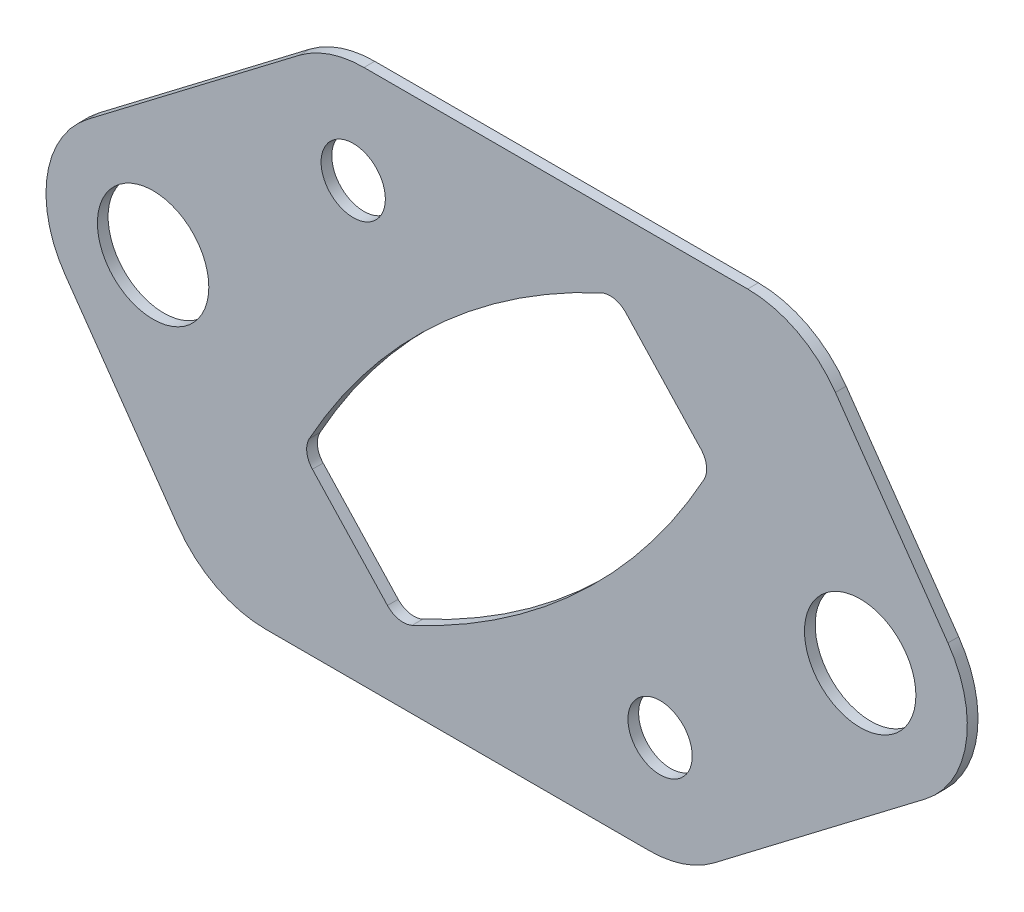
ISO-10303-21;
HEADER;
FILE_DESCRIPTION(('STEP AP214'),'2;1');
FILE_NAME('part.step','',(''),(''),'','','');
FILE_SCHEMA(('AUTOMOTIVE_DESIGN { 1 0 10303 214 1 1 1 1 }'));
ENDSEC;
DATA;
#1=APPLICATION_CONTEXT('core data for automotive mechanical design processes');
#2=APPLICATION_PROTOCOL_DEFINITION('international standard','automotive_design',2000,#1);
#3=PRODUCT_CONTEXT('',#1,'mechanical');
#4=PRODUCT('Part','Part','',(#3));
#5=PRODUCT_RELATED_PRODUCT_CATEGORY('part','',(#4));
#6=PRODUCT_DEFINITION_FORMATION('','',#4);
#7=PRODUCT_DEFINITION_CONTEXT('part definition',#1,'design');
#8=PRODUCT_DEFINITION('design','',#6,#7);
#9=PRODUCT_DEFINITION_SHAPE('','',#8);
#10=(LENGTH_UNIT() NAMED_UNIT(*) SI_UNIT(.MILLI.,.METRE.));
#11=(NAMED_UNIT(*) PLANE_ANGLE_UNIT() SI_UNIT($,.RADIAN.));
#12=(NAMED_UNIT(*) SI_UNIT($,.STERADIAN.) SOLID_ANGLE_UNIT());
#13=UNCERTAINTY_MEASURE_WITH_UNIT(LENGTH_MEASURE(1.E-05),#10,'distance_accuracy_value','');
#14=(GEOMETRIC_REPRESENTATION_CONTEXT(3) GLOBAL_UNCERTAINTY_ASSIGNED_CONTEXT((#13)) GLOBAL_UNIT_ASSIGNED_CONTEXT((#10,
#11,#12)) REPRESENTATION_CONTEXT('',''));
#15=CARTESIAN_POINT('',(0.,0.,0.));
#16=DIRECTION('',(0.,0.,1.));
#17=DIRECTION('',(1.,0.,0.));
#18=AXIS2_PLACEMENT_3D('',#15,#16,#17);
#19=CARTESIAN_POINT('',(0.,0.,0.));
#20=DIRECTION('',(0.,0.,1.));
#21=DIRECTION('',(1.,0.,0.));
#22=AXIS2_PLACEMENT_3D('',#19,#20,#21);
#23=PLANE('',#22);
#24=CARTESIAN_POINT('',(-17.04995900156,18.28384254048,0.));
#25=DIRECTION('',(0.,0.,1.));
#26=DIRECTION('',(1.,0.,0.));
#27=AXIS2_PLACEMENT_3D('',#24,#25,#26);
#28=CIRCLE('',#27,30.);
#29=CARTESIAN_POINT('',(-4.40939282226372,-8.92306993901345,0.));
#30=VERTEX_POINT('',#29);
#31=CARTESIAN_POINT('',(9.2089174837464,3.77620986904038,0.));
#32=VERTEX_POINT('',#31);
#33=EDGE_CURVE('E181',#30,#32,#28,.T.);
#34=ORIENTED_EDGE('',*,*,#33,.T.);
#35=CARTESIAN_POINT('',(8.333621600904,4.259797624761,0.));
#36=DIRECTION('',(0.,0.,1.));
#37=DIRECTION('',(1.,0.,0.));
#38=AXIS2_PLACEMENT_3D('',#35,#36,#37);
#39=CIRCLE('',#38,1.);
#40=CARTESIAN_POINT('',(9.06497530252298,4.94179598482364,0.));
#41=VERTEX_POINT('',#40);
#42=EDGE_CURVE('E184',#32,#41,#39,.T.);
#43=ORIENTED_EDGE('',*,*,#42,.T.);
#44=DIRECTION('',(0.681998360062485,-0.731353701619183,0.));
#45=VECTOR('',#44,1.);
#46=CARTESIAN_POINT('',(5.56209872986,8.698171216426,0.));
#47=LINE('',#46,#45);
#48=CARTESIAN_POINT('',(5.56209872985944,8.6981712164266,0.));
#49=VERTEX_POINT('',#48);
#50=EDGE_CURVE('E188',#49,#41,#47,.T.);
#51=ORIENTED_EDGE('',*,*,#50,.F.);
#52=CARTESIAN_POINT('',(4.830745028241,8.016172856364,0.));
#53=DIRECTION('',(0.,0.,1.));
#54=DIRECTION('',(1.,0.,0.));
#55=AXIS2_PLACEMENT_3D('',#52,#53,#54);
#56=CIRCLE('',#55,1.);
#57=CARTESIAN_POINT('',(4.40939282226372,8.92306993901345,0.));
#58=VERTEX_POINT('',#57);
#59=EDGE_CURVE('E191',#49,#58,#56,.T.);
#60=ORIENTED_EDGE('',*,*,#59,.T.);
#61=CARTESIAN_POINT('',(17.04995900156,-18.28384254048,0.));
#62=DIRECTION('',(0.,0.,1.));
#63=DIRECTION('',(1.,0.,0.));
#64=AXIS2_PLACEMENT_3D('',#61,#62,#63);
#65=CIRCLE('',#64,30.);
#66=CARTESIAN_POINT('',(-9.2089174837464,-3.77620986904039,0.));
#67=VERTEX_POINT('',#66);
#68=EDGE_CURVE('E195',#58,#67,#65,.T.);
#69=ORIENTED_EDGE('',*,*,#68,.T.);
#70=CARTESIAN_POINT('',(-8.333621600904,-4.259797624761,0.));
#71=DIRECTION('',(0.,0.,1.));
#72=DIRECTION('',(1.,0.,0.));
#73=AXIS2_PLACEMENT_3D('',#70,#71,#72);
#74=CIRCLE('',#73,1.);
#75=CARTESIAN_POINT('',(-9.06497530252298,-4.94179598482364,0.));
#76=VERTEX_POINT('',#75);
#77=EDGE_CURVE('E162',#67,#76,#74,.T.);
#78=ORIENTED_EDGE('',*,*,#77,.T.);
#79=DIRECTION('',(-0.681998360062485,0.731353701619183,0.));
#80=VECTOR('',#79,1.);
#81=CARTESIAN_POINT('',(-5.56209872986,-8.698171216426,0.));
#82=LINE('',#81,#80);
#83=CARTESIAN_POINT('',(-5.56209872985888,-8.69817121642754,0.));
#84=VERTEX_POINT('',#83);
#85=EDGE_CURVE('E159',#84,#76,#82,.T.);
#86=ORIENTED_EDGE('',*,*,#85,.F.);
#87=CARTESIAN_POINT('',(-4.830745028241,-8.016172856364,0.));
#88=DIRECTION('',(0.,0.,1.));
#89=DIRECTION('',(1.,0.,0.));
#90=AXIS2_PLACEMENT_3D('',#87,#88,#89);
#91=CIRCLE('',#90,1.);
#92=EDGE_CURVE('E20',#30,#84,#91,.F.);
#93=ORIENTED_EDGE('',*,*,#92,.F.);
#94=EDGE_LOOP('',(#34,#43,#51,#60,#69,#78,#86,#93));
#95=FACE_BOUND('',#94,.T.);
#96=CARTESIAN_POINT('',(-7.160982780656,7.679213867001,0.));
#97=DIRECTION('',(0.,0.,1.));
#98=DIRECTION('',(1.,0.,0.));
#99=AXIS2_PLACEMENT_3D('',#96,#97,#98);
#100=CIRCLE('',#99,1.5);
#101=CARTESIAN_POINT('',(-5.660982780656,7.679213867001,0.));
#102=VERTEX_POINT('',#101);
#103=EDGE_CURVE('E165',#102,#102,#100,.T.);
#104=ORIENTED_EDGE('',*,*,#103,.T.);
#105=EDGE_LOOP('',(#104));
#106=FACE_BOUND('',#105,.T.);
#107=CARTESIAN_POINT('',(7.160982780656,-7.679213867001,0.));
#108=DIRECTION('',(0.,0.,1.));
#109=DIRECTION('',(1.,0.,0.));
#110=AXIS2_PLACEMENT_3D('',#107,#108,#109);
#111=CIRCLE('',#110,1.5);
#112=CARTESIAN_POINT('',(8.660982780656,-7.679213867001,0.));
#113=VERTEX_POINT('',#112);
#114=EDGE_CURVE('E307',#113,#113,#111,.T.);
#115=ORIENTED_EDGE('',*,*,#114,.T.);
#116=EDGE_LOOP('',(#115));
#117=FACE_BOUND('',#116,.T.);
#118=CARTESIAN_POINT('',(-16.5,0.,0.));
#119=DIRECTION('',(0.,0.,1.));
#120=DIRECTION('',(1.,0.,0.));
#121=AXIS2_PLACEMENT_3D('',#118,#119,#120);
#122=CIRCLE('',#121,2.6);
#123=CARTESIAN_POINT('',(-13.9,0.,0.));
#124=VERTEX_POINT('',#123);
#125=EDGE_CURVE('E310',#124,#124,#122,.T.);
#126=ORIENTED_EDGE('',*,*,#125,.T.);
#127=EDGE_LOOP('',(#126));
#128=FACE_BOUND('',#127,.T.);
#129=CARTESIAN_POINT('',(16.5,0.,0.));
#130=DIRECTION('',(0.,0.,1.));
#131=DIRECTION('',(1.,0.,0.));
#132=AXIS2_PLACEMENT_3D('',#129,#130,#131);
#133=CIRCLE('',#132,2.6);
#134=CARTESIAN_POINT('',(19.1,0.,0.));
#135=VERTEX_POINT('',#134);
#136=EDGE_CURVE('E313',#135,#135,#133,.T.);
#137=ORIENTED_EDGE('',*,*,#136,.T.);
#138=EDGE_LOOP('',(#137));
#139=FACE_BOUND('',#138,.T.);
#140=CARTESIAN_POINT('',(-6.656696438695,7.5,0.));
#141=DIRECTION('',(0.,0.,1.));
#142=DIRECTION('',(1.,0.,0.));
#143=AXIS2_PLACEMENT_3D('',#140,#141,#142);
#144=CIRCLE('',#143,5.);
#145=CARTESIAN_POINT('',(-6.656696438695,12.5,0.));
#146=VERTEX_POINT('',#145);
#147=CARTESIAN_POINT('',(-9.68699946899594,11.4770923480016,0.));
#148=VERTEX_POINT('',#147);
#149=EDGE_CURVE('E209',#146,#148,#144,.T.);
#150=ORIENTED_EDGE('',*,*,#149,.F.);
#151=DIRECTION('',(1.,0.,0.));
#152=VECTOR('',#151,1.);
#153=CARTESIAN_POINT('',(11.24844346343,12.5,0.));
#154=LINE('',#153,#152);
#155=CARTESIAN_POINT('',(11.24844346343,12.5,0.));
#156=VERTEX_POINT('',#155);
#157=EDGE_CURVE('E213',#156,#146,#154,.F.);
#158=ORIENTED_EDGE('',*,*,#157,.F.);
#159=CARTESIAN_POINT('',(11.24844346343,7.5,0.));
#160=DIRECTION('',(0.,0.,1.));
#161=DIRECTION('',(1.,0.,0.));
#162=AXIS2_PLACEMENT_3D('',#159,#160,#161);
#163=CIRCLE('',#162,5.);
#164=CARTESIAN_POINT('',(15.3442036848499,10.3678821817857,0.));
#165=VERTEX_POINT('',#164);
#166=EDGE_CURVE('E217',#165,#156,#163,.T.);
#167=ORIENTED_EDGE('',*,*,#166,.F.);
#168=DIRECTION('',(-0.573576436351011,0.819152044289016,0.));
#169=VECTOR('',#168,1.);
#170=CARTESIAN_POINT('',(20.59576022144,2.867882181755,0.));
#171=LINE('',#170,#169);
#172=CARTESIAN_POINT('',(20.5957602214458,2.86788218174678,0.));
#173=VERTEX_POINT('',#172);
#174=EDGE_CURVE('E221',#173,#165,#171,.T.);
#175=ORIENTED_EDGE('',*,*,#174,.F.);
#176=CARTESIAN_POINT('',(16.5,0.,0.));
#177=DIRECTION('',(0.,0.,1.));
#178=DIRECTION('',(1.,0.,0.));
#179=AXIS2_PLACEMENT_3D('',#176,#177,#178);
#180=CIRCLE('',#179,5.);
#181=CARTESIAN_POINT('',(19.5303030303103,-3.97709234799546,0.));
#182=VERTEX_POINT('',#181);
#183=EDGE_CURVE('E225',#182,#173,#180,.T.);
#184=ORIENTED_EDGE('',*,*,#183,.F.);
#185=DIRECTION('',(0.795418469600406,0.606060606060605,0.));
#186=VECTOR('',#185,1.);
#187=CARTESIAN_POINT('',(9.686999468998,-11.477092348,0.));
#188=LINE('',#187,#186);
#189=CARTESIAN_POINT('',(9.68699946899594,-11.4770923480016,0.));
#190=VERTEX_POINT('',#189);
#191=EDGE_CURVE('E229',#190,#182,#188,.T.);
#192=ORIENTED_EDGE('',*,*,#191,.F.);
#193=CARTESIAN_POINT('',(6.656696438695,-7.5,0.));
#194=DIRECTION('',(0.,0.,1.));
#195=DIRECTION('',(1.,0.,0.));
#196=AXIS2_PLACEMENT_3D('',#193,#194,#195);
#197=CIRCLE('',#196,5.);
#198=CARTESIAN_POINT('',(6.656696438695,-12.5,0.));
#199=VERTEX_POINT('',#198);
#200=EDGE_CURVE('E233',#199,#190,#197,.T.);
#201=ORIENTED_EDGE('',*,*,#200,.F.);
#202=DIRECTION('',(1.,0.,0.));
#203=VECTOR('',#202,1.);
#204=CARTESIAN_POINT('',(-11.24844346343,-12.5,0.));
#205=LINE('',#204,#203);
#206=CARTESIAN_POINT('',(-11.24844346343,-12.5,0.));
#207=VERTEX_POINT('',#206);
#208=EDGE_CURVE('E237',#207,#199,#205,.T.);
#209=ORIENTED_EDGE('',*,*,#208,.F.);
#210=CARTESIAN_POINT('',(-11.24844346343,-7.5,0.));
#211=DIRECTION('',(0.,0.,1.));
#212=DIRECTION('',(1.,0.,0.));
#213=AXIS2_PLACEMENT_3D('',#210,#211,#212);
#214=CIRCLE('',#213,5.);
#215=CARTESIAN_POINT('',(-15.3442036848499,-10.3678821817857,0.));
#216=VERTEX_POINT('',#215);
#217=EDGE_CURVE('E241',#216,#207,#214,.T.);
#218=ORIENTED_EDGE('',*,*,#217,.F.);
#219=DIRECTION('',(0.573576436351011,-0.819152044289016,0.));
#220=VECTOR('',#219,1.);
#221=CARTESIAN_POINT('',(-20.59576022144,-2.867882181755,0.));
#222=LINE('',#221,#220);
#223=CARTESIAN_POINT('',(-20.5957602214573,-2.86788218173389,0.));
#224=VERTEX_POINT('',#223);
#225=EDGE_CURVE('E157',#224,#216,#222,.T.);
#226=ORIENTED_EDGE('',*,*,#225,.F.);
#227=CARTESIAN_POINT('',(-16.5,0.,0.));
#228=DIRECTION('',(0.,0.,1.));
#229=DIRECTION('',(1.,0.,0.));
#230=AXIS2_PLACEMENT_3D('',#227,#228,#229);
#231=CIRCLE('',#230,5.);
#232=CARTESIAN_POINT('',(-19.5303030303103,3.97709234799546,0.));
#233=VERTEX_POINT('',#232);
#234=EDGE_CURVE('E205',#233,#224,#231,.T.);
#235=ORIENTED_EDGE('',*,*,#234,.F.);
#236=DIRECTION('',(-0.795418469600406,-0.606060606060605,0.));
#237=VECTOR('',#236,1.);
#238=CARTESIAN_POINT('',(-9.686999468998,11.477092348,0.));
#239=LINE('',#238,#237);
#240=EDGE_CURVE('E202',#148,#233,#239,.T.);
#241=ORIENTED_EDGE('',*,*,#240,.F.);
#242=EDGE_LOOP('',(#150,#158,#167,#175,#184,#192,#201,#209,#218,#226,#235,#241));
#243=FACE_BOUND('',#242,.T.);
#244=ADVANCED_FACE('F16',(#95,#106,#117,#128,#139,#243),#23,.F.);
#245=CARTESIAN_POINT('',(-20.59576022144,-2.867882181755,0.));
#246=DIRECTION('',(-0.819152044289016,-0.573576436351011,0.));
#247=DIRECTION('',(0.573576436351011,-0.819152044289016,0.));
#248=AXIS2_PLACEMENT_3D('',#245,#246,#247);
#249=PLANE('',#248);
#250=DIRECTION('',(0.,0.,1.));
#251=VECTOR('',#250,1.);
#252=CARTESIAN_POINT('',(-20.595760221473,-2.86788218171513,0.));
#253=LINE('',#252,#251);
#254=CARTESIAN_POINT('',(-20.5957602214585,-2.8678821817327,0.5));
#255=VERTEX_POINT('',#254);
#256=EDGE_CURVE('E198',#224,#255,#253,.T.);
#257=ORIENTED_EDGE('',*,*,#256,.F.);
#258=ORIENTED_EDGE('',*,*,#225,.T.);
#259=DIRECTION('',(0.,0.,1.));
#260=VECTOR('',#259,1.);
#261=CARTESIAN_POINT('',(-15.3442036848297,-10.3678821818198,0.));
#262=LINE('',#261,#260);
#263=CARTESIAN_POINT('',(-15.3442036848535,-10.3678821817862,0.5));
#264=VERTEX_POINT('',#263);
#265=EDGE_CURVE('E242',#264,#216,#262,.F.);
#266=ORIENTED_EDGE('',*,*,#265,.F.);
#267=DIRECTION('',(0.573576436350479,-0.819152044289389,0.));
#268=VECTOR('',#267,1.);
#269=CARTESIAN_POINT('',(-20.59576022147,-2.867882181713,0.5));
#270=LINE('',#269,#268);
#271=EDGE_CURVE('E171',#255,#264,#270,.T.);
#272=ORIENTED_EDGE('',*,*,#271,.F.);
#273=EDGE_LOOP('',(#257,#258,#266,#272));
#274=FACE_BOUND('',#273,.T.);
#275=ADVANCED_FACE('F342',(#274),#249,.T.);
#276=CARTESIAN_POINT('',(-11.24844346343,-7.5,0.));
#277=DIRECTION('',(0.,0.,1.));
#278=DIRECTION('',(1.,0.,0.));
#279=AXIS2_PLACEMENT_3D('',#276,#277,#278);
#280=CYLINDRICAL_SURFACE('',#279,5.);
#281=ORIENTED_EDGE('',*,*,#265,.T.);
#282=ORIENTED_EDGE('',*,*,#217,.T.);
#283=DIRECTION('',(0.,0.,-1.));
#284=VECTOR('',#283,1.);
#285=CARTESIAN_POINT('',(-11.24844346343,-12.5,0.));
#286=LINE('',#285,#284);
#287=CARTESIAN_POINT('',(-11.24844346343,-12.5,0.5));
#288=VERTEX_POINT('',#287);
#289=EDGE_CURVE('E238',#288,#207,#286,.T.);
#290=ORIENTED_EDGE('',*,*,#289,.F.);
#291=CARTESIAN_POINT('',(-11.24844346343,-7.5,0.5));
#292=DIRECTION('',(0.,0.,1.));
#293=DIRECTION('',(1.,0.,0.));
#294=AXIS2_PLACEMENT_3D('',#291,#292,#293);
#295=CIRCLE('',#294,5.);
#296=EDGE_CURVE('E174',#264,#288,#295,.T.);
#297=ORIENTED_EDGE('',*,*,#296,.F.);
#298=EDGE_LOOP('',(#281,#282,#290,#297));
#299=FACE_BOUND('',#298,.T.);
#300=ADVANCED_FACE('F324',(#299),#280,.T.);
#301=CARTESIAN_POINT('',(-11.24844346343,-12.5,0.));
#302=DIRECTION('',(0.,-1.,0.));
#303=DIRECTION('',(0.,0.,-1.));
#304=AXIS2_PLACEMENT_3D('',#301,#302,#303);
#305=PLANE('',#304);
#306=ORIENTED_EDGE('',*,*,#289,.T.);
#307=ORIENTED_EDGE('',*,*,#208,.T.);
#308=DIRECTION('',(0.,0.,1.));
#309=VECTOR('',#308,1.);
#310=CARTESIAN_POINT('',(6.656696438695,-12.5,0.));
#311=LINE('',#310,#309);
#312=CARTESIAN_POINT('',(6.656696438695,-12.5,0.5));
#313=VERTEX_POINT('',#312);
#314=EDGE_CURVE('E234',#313,#199,#311,.F.);
#315=ORIENTED_EDGE('',*,*,#314,.F.);
#316=DIRECTION('',(1.,0.,0.));
#317=VECTOR('',#316,1.);
#318=CARTESIAN_POINT('',(0.,-12.5,0.5));
#319=LINE('',#318,#317);
#320=EDGE_CURVE('E297',#288,#313,#319,.T.);
#321=ORIENTED_EDGE('',*,*,#320,.F.);
#322=EDGE_LOOP('',(#306,#307,#315,#321));
#323=FACE_BOUND('',#322,.T.);
#324=ADVANCED_FACE('F332',(#323),#305,.T.);
#325=CARTESIAN_POINT('',(6.656696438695,-7.5,0.));
#326=DIRECTION('',(0.,0.,1.));
#327=DIRECTION('',(1.,0.,0.));
#328=AXIS2_PLACEMENT_3D('',#325,#326,#327);
#329=CYLINDRICAL_SURFACE('',#328,5.);
#330=ORIENTED_EDGE('',*,*,#314,.T.);
#331=ORIENTED_EDGE('',*,*,#200,.T.);
#332=DIRECTION('',(0.,0.,1.));
#333=VECTOR('',#332,1.);
#334=CARTESIAN_POINT('',(9.68699946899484,-11.4770923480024,0.));
#335=LINE('',#334,#333);
#336=CARTESIAN_POINT('',(9.6869994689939,-11.4770923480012,0.5));
#337=VERTEX_POINT('',#336);
#338=EDGE_CURVE('E230',#337,#190,#335,.F.);
#339=ORIENTED_EDGE('',*,*,#338,.F.);
#340=CARTESIAN_POINT('',(6.656696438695,-7.5,0.5));
#341=DIRECTION('',(0.,0.,1.));
#342=DIRECTION('',(1.,0.,0.));
#343=AXIS2_PLACEMENT_3D('',#340,#341,#342);
#344=CIRCLE('',#343,5.);
#345=EDGE_CURVE('E294',#313,#337,#344,.T.);
#346=ORIENTED_EDGE('',*,*,#345,.F.);
#347=EDGE_LOOP('',(#330,#331,#339,#346));
#348=FACE_BOUND('',#347,.T.);
#349=ADVANCED_FACE('F542',(#348),#329,.T.);
#350=CARTESIAN_POINT('',(9.686999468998,-11.477092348,0.));
#351=DIRECTION('',(0.606060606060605,-0.795418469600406,0.));
#352=DIRECTION('',(0.795418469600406,0.606060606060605,0.));
#353=AXIS2_PLACEMENT_3D('',#350,#351,#352);
#354=PLANE('',#353);
#355=ORIENTED_EDGE('',*,*,#338,.T.);
#356=ORIENTED_EDGE('',*,*,#191,.T.);
#357=DIRECTION('',(0.,0.,1.));
#358=VECTOR('',#357,1.);
#359=CARTESIAN_POINT('',(19.5303030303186,-3.97709234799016,0.));
#360=LINE('',#359,#358);
#361=CARTESIAN_POINT('',(19.5303030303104,-3.97709234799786,0.5));
#362=VERTEX_POINT('',#361);
#363=EDGE_CURVE('E226',#362,#182,#360,.F.);
#364=ORIENTED_EDGE('',*,*,#363,.F.);
#365=DIRECTION('',(0.795418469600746,0.606060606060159,0.));
#366=VECTOR('',#365,1.);
#367=CARTESIAN_POINT('',(9.686999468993,-11.477092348,0.5));
#368=LINE('',#367,#366);
#369=EDGE_CURVE('E293',#337,#362,#368,.T.);
#370=ORIENTED_EDGE('',*,*,#369,.F.);
#371=EDGE_LOOP('',(#355,#356,#364,#370));
#372=FACE_BOUND('',#371,.T.);
#373=ADVANCED_FACE('F369',(#372),#354,.T.);
#374=CARTESIAN_POINT('',(16.5,0.,0.));
#375=DIRECTION('',(0.,0.,1.));
#376=DIRECTION('',(1.,0.,0.));
#377=AXIS2_PLACEMENT_3D('',#374,#375,#376);
#378=CYLINDRICAL_SURFACE('',#377,5.);
#379=ORIENTED_EDGE('',*,*,#363,.T.);
#380=ORIENTED_EDGE('',*,*,#183,.T.);
#381=DIRECTION('',(0.,0.,1.));
#382=VECTOR('',#381,1.);
#383=CARTESIAN_POINT('',(20.5957602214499,2.86788218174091,0.));
#384=LINE('',#383,#382);
#385=CARTESIAN_POINT('',(20.5957602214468,2.86788218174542,0.5));
#386=VERTEX_POINT('',#385);
#387=EDGE_CURVE('E222',#386,#173,#384,.F.);
#388=ORIENTED_EDGE('',*,*,#387,.F.);
#389=CARTESIAN_POINT('',(16.5,0.,0.5));
#390=DIRECTION('',(0.,0.,1.));
#391=DIRECTION('',(1.,0.,0.));
#392=AXIS2_PLACEMENT_3D('',#389,#390,#391);
#393=CIRCLE('',#392,5.);
#394=EDGE_CURVE('E291',#362,#386,#393,.T.);
#395=ORIENTED_EDGE('',*,*,#394,.F.);
#396=EDGE_LOOP('',(#379,#380,#388,#395));
#397=FACE_BOUND('',#396,.T.);
#398=ADVANCED_FACE('F372',(#397),#378,.T.);
#399=CARTESIAN_POINT('',(20.59576022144,2.867882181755,0.));
#400=DIRECTION('',(0.819152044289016,0.573576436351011,0.));
#401=DIRECTION('',(-0.573576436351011,0.819152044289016,0.));
#402=AXIS2_PLACEMENT_3D('',#399,#400,#401);
#403=PLANE('',#402);
#404=ORIENTED_EDGE('',*,*,#387,.T.);
#405=ORIENTED_EDGE('',*,*,#174,.T.);
#406=DIRECTION('',(0.,0.,1.));
#407=VECTOR('',#406,1.);
#408=CARTESIAN_POINT('',(15.3442036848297,10.3678821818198,0.));
#409=LINE('',#408,#407);
#410=CARTESIAN_POINT('',(15.3442036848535,10.3678821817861,0.5));
#411=VERTEX_POINT('',#410);
#412=EDGE_CURVE('E218',#411,#165,#409,.F.);
#413=ORIENTED_EDGE('',*,*,#412,.F.);
#414=DIRECTION('',(-0.57357643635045,0.819152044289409,0.));
#415=VECTOR('',#414,1.);
#416=CARTESIAN_POINT('',(20.59576022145,2.867882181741,0.5));
#417=LINE('',#416,#415);
#418=EDGE_CURVE('E290',#386,#411,#417,.T.);
#419=ORIENTED_EDGE('',*,*,#418,.F.);
#420=EDGE_LOOP('',(#404,#405,#413,#419));
#421=FACE_BOUND('',#420,.T.);
#422=ADVANCED_FACE('F365',(#421),#403,.T.);
#423=CARTESIAN_POINT('',(11.24844346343,7.5,0.));
#424=DIRECTION('',(0.,0.,1.));
#425=DIRECTION('',(1.,0.,0.));
#426=AXIS2_PLACEMENT_3D('',#423,#424,#425);
#427=CYLINDRICAL_SURFACE('',#426,5.);
#428=ORIENTED_EDGE('',*,*,#412,.T.);
#429=ORIENTED_EDGE('',*,*,#166,.T.);
#430=DIRECTION('',(0.,0.,1.));
#431=VECTOR('',#430,1.);
#432=CARTESIAN_POINT('',(11.24844346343,12.5,0.));
#433=LINE('',#432,#431);
#434=CARTESIAN_POINT('',(11.24844346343,12.5,0.5));
#435=VERTEX_POINT('',#434);
#436=EDGE_CURVE('E214',#435,#156,#433,.F.);
#437=ORIENTED_EDGE('',*,*,#436,.F.);
#438=CARTESIAN_POINT('',(11.24844346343,7.5,0.5));
#439=DIRECTION('',(0.,0.,1.));
#440=DIRECTION('',(1.,0.,0.));
#441=AXIS2_PLACEMENT_3D('',#438,#439,#440);
#442=CIRCLE('',#441,5.);
#443=EDGE_CURVE('E287',#411,#435,#442,.T.);
#444=ORIENTED_EDGE('',*,*,#443,.F.);
#445=EDGE_LOOP('',(#428,#429,#437,#444));
#446=FACE_BOUND('',#445,.T.);
#447=ADVANCED_FACE('F361',(#446),#427,.T.);
#448=CARTESIAN_POINT('',(11.24844346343,12.5,0.));
#449=DIRECTION('',(0.,1.,0.));
#450=DIRECTION('',(0.,0.,1.));
#451=AXIS2_PLACEMENT_3D('',#448,#449,#450);
#452=PLANE('',#451);
#453=ORIENTED_EDGE('',*,*,#436,.T.);
#454=ORIENTED_EDGE('',*,*,#157,.T.);
#455=DIRECTION('',(0.,0.,1.));
#456=VECTOR('',#455,1.);
#457=CARTESIAN_POINT('',(-6.656696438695,12.5,0.));
#458=LINE('',#457,#456);
#459=CARTESIAN_POINT('',(-6.656696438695,12.5,0.5));
#460=VERTEX_POINT('',#459);
#461=EDGE_CURVE('E210',#460,#146,#458,.F.);
#462=ORIENTED_EDGE('',*,*,#461,.F.);
#463=DIRECTION('',(1.,0.,0.));
#464=VECTOR('',#463,1.);
#465=CARTESIAN_POINT('',(0.,12.5,0.5));
#466=LINE('',#465,#464);
#467=EDGE_CURVE('E286',#435,#460,#466,.F.);
#468=ORIENTED_EDGE('',*,*,#467,.F.);
#469=EDGE_LOOP('',(#453,#454,#462,#468));
#470=FACE_BOUND('',#469,.T.);
#471=ADVANCED_FACE('F358',(#470),#452,.T.);
#472=CARTESIAN_POINT('',(-6.656696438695,7.5,0.));
#473=DIRECTION('',(0.,0.,1.));
#474=DIRECTION('',(1.,0.,0.));
#475=AXIS2_PLACEMENT_3D('',#472,#473,#474);
#476=CYLINDRICAL_SURFACE('',#475,5.);
#477=ORIENTED_EDGE('',*,*,#461,.T.);
#478=ORIENTED_EDGE('',*,*,#149,.T.);
#479=DIRECTION('',(0.,0.,1.));
#480=VECTOR('',#479,1.);
#481=CARTESIAN_POINT('',(-9.68699946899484,11.4770923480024,0.));
#482=LINE('',#481,#480);
#483=CARTESIAN_POINT('',(-9.6869994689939,11.4770923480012,0.5));
#484=VERTEX_POINT('',#483);
#485=EDGE_CURVE('E206',#484,#148,#482,.F.);
#486=ORIENTED_EDGE('',*,*,#485,.F.);
#487=CARTESIAN_POINT('',(-6.656696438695,7.5,0.5));
#488=DIRECTION('',(0.,0.,1.));
#489=DIRECTION('',(1.,0.,0.));
#490=AXIS2_PLACEMENT_3D('',#487,#488,#489);
#491=CIRCLE('',#490,5.);
#492=EDGE_CURVE('E283',#460,#484,#491,.T.);
#493=ORIENTED_EDGE('',*,*,#492,.F.);
#494=EDGE_LOOP('',(#477,#478,#486,#493));
#495=FACE_BOUND('',#494,.T.);
#496=ADVANCED_FACE('F351',(#495),#476,.T.);
#497=CARTESIAN_POINT('',(-9.686999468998,11.477092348,0.));
#498=DIRECTION('',(-0.606060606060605,0.795418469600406,0.));
#499=DIRECTION('',(-0.795418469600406,-0.606060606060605,0.));
#500=AXIS2_PLACEMENT_3D('',#497,#498,#499);
#501=PLANE('',#500);
#502=ORIENTED_EDGE('',*,*,#485,.T.);
#503=ORIENTED_EDGE('',*,*,#240,.T.);
#504=DIRECTION('',(0.,0.,1.));
#505=VECTOR('',#504,1.);
#506=CARTESIAN_POINT('',(-19.5303030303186,3.97709234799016,0.));
#507=LINE('',#506,#505);
#508=CARTESIAN_POINT('',(-19.5303030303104,3.97709234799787,0.5));
#509=VERTEX_POINT('',#508);
#510=EDGE_CURVE('E201',#509,#233,#507,.F.);
#511=ORIENTED_EDGE('',*,*,#510,.F.);
#512=DIRECTION('',(-0.795418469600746,-0.606060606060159,0.));
#513=VECTOR('',#512,1.);
#514=CARTESIAN_POINT('',(-9.686999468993,11.477092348,0.5));
#515=LINE('',#514,#513);
#516=EDGE_CURVE('E282',#484,#509,#515,.T.);
#517=ORIENTED_EDGE('',*,*,#516,.F.);
#518=EDGE_LOOP('',(#502,#503,#511,#517));
#519=FACE_BOUND('',#518,.T.);
#520=ADVANCED_FACE('F347',(#519),#501,.T.);
#521=CARTESIAN_POINT('',(-16.5,0.,0.));
#522=DIRECTION('',(0.,0.,1.));
#523=DIRECTION('',(1.,0.,0.));
#524=AXIS2_PLACEMENT_3D('',#521,#522,#523);
#525=CYLINDRICAL_SURFACE('',#524,5.);
#526=ORIENTED_EDGE('',*,*,#510,.T.);
#527=ORIENTED_EDGE('',*,*,#234,.T.);
#528=ORIENTED_EDGE('',*,*,#256,.T.);
#529=CARTESIAN_POINT('',(-16.5,0.,0.5));
#530=DIRECTION('',(0.,0.,1.));
#531=DIRECTION('',(1.,0.,0.));
#532=AXIS2_PLACEMENT_3D('',#529,#530,#531);
#533=CIRCLE('',#532,5.);
#534=EDGE_CURVE('E280',#509,#255,#533,.T.);
#535=ORIENTED_EDGE('',*,*,#534,.F.);
#536=EDGE_LOOP('',(#526,#527,#528,#535));
#537=FACE_BOUND('',#536,.T.);
#538=ADVANCED_FACE('F344',(#537),#525,.T.);
#539=CARTESIAN_POINT('',(16.5,0.,0.));
#540=DIRECTION('',(0.,0.,1.));
#541=DIRECTION('',(1.,0.,0.));
#542=AXIS2_PLACEMENT_3D('',#539,#540,#541);
#543=CYLINDRICAL_SURFACE('',#542,2.6);
#544=CARTESIAN_POINT('',(16.5,0.,0.5));
#545=DIRECTION('',(0.,0.,1.));
#546=DIRECTION('',(1.,0.,0.));
#547=AXIS2_PLACEMENT_3D('',#544,#545,#546);
#548=CIRCLE('',#547,2.6);
#549=CARTESIAN_POINT('',(19.1,0.,0.5));
#550=VERTEX_POINT('',#549);
#551=EDGE_CURVE('E277',#550,#550,#548,.F.);
#552=ORIENTED_EDGE('',*,*,#551,.F.);
#553=EDGE_LOOP('',(#552));
#554=FACE_BOUND('',#553,.T.);
#555=ORIENTED_EDGE('',*,*,#136,.F.);
#556=EDGE_LOOP('',(#555));
#557=FACE_BOUND('',#556,.T.);
#558=ADVANCED_FACE('F485',(#554,#557),#543,.F.);
#559=CARTESIAN_POINT('',(-16.5,0.,0.));
#560=DIRECTION('',(0.,0.,1.));
#561=DIRECTION('',(1.,0.,0.));
#562=AXIS2_PLACEMENT_3D('',#559,#560,#561);
#563=CYLINDRICAL_SURFACE('',#562,2.6);
#564=CARTESIAN_POINT('',(-16.5,0.,0.5));
#565=DIRECTION('',(0.,0.,1.));
#566=DIRECTION('',(1.,0.,0.));
#567=AXIS2_PLACEMENT_3D('',#564,#565,#566);
#568=CIRCLE('',#567,2.6);
#569=CARTESIAN_POINT('',(-13.9,0.,0.5));
#570=VERTEX_POINT('',#569);
#571=EDGE_CURVE('E274',#570,#570,#568,.F.);
#572=ORIENTED_EDGE('',*,*,#571,.F.);
#573=EDGE_LOOP('',(#572));
#574=FACE_BOUND('',#573,.T.);
#575=ORIENTED_EDGE('',*,*,#125,.F.);
#576=EDGE_LOOP('',(#575));
#577=FACE_BOUND('',#576,.T.);
#578=ADVANCED_FACE('F477',(#574,#577),#563,.F.);
#579=CARTESIAN_POINT('',(7.160982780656,-7.679213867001,0.));
#580=DIRECTION('',(0.,0.,1.));
#581=DIRECTION('',(1.,0.,0.));
#582=AXIS2_PLACEMENT_3D('',#579,#580,#581);
#583=CYLINDRICAL_SURFACE('',#582,1.5);
#584=CARTESIAN_POINT('',(7.160982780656,-7.679213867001,0.5));
#585=DIRECTION('',(0.,0.,1.));
#586=DIRECTION('',(1.,0.,0.));
#587=AXIS2_PLACEMENT_3D('',#584,#585,#586);
#588=CIRCLE('',#587,1.5);
#589=CARTESIAN_POINT('',(8.660982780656,-7.679213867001,0.5));
#590=VERTEX_POINT('',#589);
#591=EDGE_CURVE('E271',#590,#590,#588,.F.);
#592=ORIENTED_EDGE('',*,*,#591,.F.);
#593=EDGE_LOOP('',(#592));
#594=FACE_BOUND('',#593,.T.);
#595=ORIENTED_EDGE('',*,*,#114,.F.);
#596=EDGE_LOOP('',(#595));
#597=FACE_BOUND('',#596,.T.);
#598=ADVANCED_FACE('F469',(#594,#597),#583,.F.);
#599=CARTESIAN_POINT('',(-7.160982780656,7.679213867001,0.));
#600=DIRECTION('',(0.,0.,1.));
#601=DIRECTION('',(1.,0.,0.));
#602=AXIS2_PLACEMENT_3D('',#599,#600,#601);
#603=CYLINDRICAL_SURFACE('',#602,1.5);
#604=CARTESIAN_POINT('',(-7.160982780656,7.679213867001,0.5));
#605=DIRECTION('',(0.,0.,1.));
#606=DIRECTION('',(1.,0.,0.));
#607=AXIS2_PLACEMENT_3D('',#604,#605,#606);
#608=CIRCLE('',#607,1.5);
#609=CARTESIAN_POINT('',(-5.660982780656,7.679213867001,0.5));
#610=VERTEX_POINT('',#609);
#611=EDGE_CURVE('E268',#610,#610,#608,.F.);
#612=ORIENTED_EDGE('',*,*,#611,.F.);
#613=EDGE_LOOP('',(#612));
#614=FACE_BOUND('',#613,.T.);
#615=ORIENTED_EDGE('',*,*,#103,.F.);
#616=EDGE_LOOP('',(#615));
#617=FACE_BOUND('',#616,.T.);
#618=ADVANCED_FACE('F462',(#614,#617),#603,.F.);
#619=CARTESIAN_POINT('',(-5.56209872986,-8.698171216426,0.));
#620=DIRECTION('',(0.731353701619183,0.681998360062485,0.));
#621=DIRECTION('',(-0.681998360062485,0.731353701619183,0.));
#622=AXIS2_PLACEMENT_3D('',#619,#620,#621);
#623=PLANE('',#622);
#624=DIRECTION('',(0.,0.,1.));
#625=VECTOR('',#624,1.);
#626=CARTESIAN_POINT('',(-5.56209872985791,-8.69817121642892,0.));
#627=LINE('',#626,#625);
#628=CARTESIAN_POINT('',(-5.56209872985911,-8.69817121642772,0.5));
#629=VERTEX_POINT('',#628);
#630=EDGE_CURVE('E156',#629,#84,#627,.F.);
#631=ORIENTED_EDGE('',*,*,#630,.T.);
#632=ORIENTED_EDGE('',*,*,#85,.T.);
#633=DIRECTION('',(0.,0.,1.));
#634=VECTOR('',#633,1.);
#635=CARTESIAN_POINT('',(-9.06497530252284,-4.94179598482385,0.));
#636=LINE('',#635,#634);
#637=CARTESIAN_POINT('',(-9.06497530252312,-4.94179598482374,0.5));
#638=VERTEX_POINT('',#637);
#639=EDGE_CURVE('E196',#76,#638,#636,.T.);
#640=ORIENTED_EDGE('',*,*,#639,.T.);
#641=DIRECTION('',(-0.681998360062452,0.731353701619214,0.));
#642=VECTOR('',#641,1.);
#643=CARTESIAN_POINT('',(-5.562098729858,-8.698171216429,0.5));
#644=LINE('',#643,#642);
#645=EDGE_CURVE('E170',#629,#638,#644,.T.);
#646=ORIENTED_EDGE('',*,*,#645,.F.);
#647=EDGE_LOOP('',(#631,#632,#640,#646));
#648=FACE_BOUND('',#647,.T.);
#649=ADVANCED_FACE('F168',(#648),#623,.T.);
#650=CARTESIAN_POINT('',(-8.333621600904,-4.259797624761,0.));
#651=DIRECTION('',(0.,0.,1.));
#652=DIRECTION('',(1.,0.,0.));
#653=AXIS2_PLACEMENT_3D('',#650,#651,#652);
#654=CYLINDRICAL_SURFACE('',#653,1.);
#655=DIRECTION('',(0.,0.,1.));
#656=VECTOR('',#655,1.);
#657=CARTESIAN_POINT('',(-9.20891748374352,-3.77620986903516,0.));
#658=LINE('',#657,#656);
#659=CARTESIAN_POINT('',(-9.2089174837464,-3.77620986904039,0.5));
#660=VERTEX_POINT('',#659);
#661=EDGE_CURVE('E192',#67,#660,#658,.T.);
#662=ORIENTED_EDGE('',*,*,#661,.T.);
#663=CARTESIAN_POINT('',(-8.333621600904,-4.259797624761,0.5));
#664=DIRECTION('',(0.,0.,1.));
#665=DIRECTION('',(1.,0.,0.));
#666=AXIS2_PLACEMENT_3D('',#663,#664,#665);
#667=CIRCLE('',#666,1.);
#668=EDGE_CURVE('E266',#638,#660,#667,.F.);
#669=ORIENTED_EDGE('',*,*,#668,.F.);
#670=ORIENTED_EDGE('',*,*,#639,.F.);
#671=ORIENTED_EDGE('',*,*,#77,.F.);
#672=EDGE_LOOP('',(#662,#669,#670,#671));
#673=FACE_BOUND('',#672,.T.);
#674=ADVANCED_FACE('F398',(#673),#654,.F.);
#675=CARTESIAN_POINT('',(17.04995900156,-18.28384254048,0.));
#676=DIRECTION('',(0.,0.,1.));
#677=DIRECTION('',(1.,0.,0.));
#678=AXIS2_PLACEMENT_3D('',#675,#676,#677);
#679=CYLINDRICAL_SURFACE('',#678,30.);
#680=CARTESIAN_POINT('',(17.04995900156,-18.28384254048,0.5));
#681=DIRECTION('',(0.,0.,1.));
#682=DIRECTION('',(1.,0.,0.));
#683=AXIS2_PLACEMENT_3D('',#680,#681,#682);
#684=CIRCLE('',#683,30.);
#685=CARTESIAN_POINT('',(4.40939282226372,8.92306993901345,0.5));
#686=VERTEX_POINT('',#685);
#687=EDGE_CURVE('E263',#660,#686,#684,.F.);
#688=ORIENTED_EDGE('',*,*,#687,.F.);
#689=ORIENTED_EDGE('',*,*,#661,.F.);
#690=ORIENTED_EDGE('',*,*,#68,.F.);
#691=DIRECTION('',(0.,0.,1.));
#692=VECTOR('',#691,1.);
#693=CARTESIAN_POINT('',(4.40939282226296,8.92306993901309,0.));
#694=LINE('',#693,#692);
#695=EDGE_CURVE('E189',#58,#686,#694,.T.);
#696=ORIENTED_EDGE('',*,*,#695,.T.);
#697=EDGE_LOOP('',(#688,#689,#690,#696));
#698=FACE_BOUND('',#697,.T.);
#699=ADVANCED_FACE('F401',(#698),#679,.F.);
#700=CARTESIAN_POINT('',(4.830745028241,8.016172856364,0.));
#701=DIRECTION('',(0.,0.,1.));
#702=DIRECTION('',(1.,0.,0.));
#703=AXIS2_PLACEMENT_3D('',#700,#701,#702);
#704=CYLINDRICAL_SURFACE('',#703,1.);
#705=CARTESIAN_POINT('',(4.830745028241,8.016172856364,0.5));
#706=DIRECTION('',(0.,0.,1.));
#707=DIRECTION('',(1.,0.,0.));
#708=AXIS2_PLACEMENT_3D('',#705,#706,#707);
#709=CIRCLE('',#708,1.);
#710=CARTESIAN_POINT('',(5.56209872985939,8.69817121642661,0.5));
#711=VERTEX_POINT('',#710);
#712=EDGE_CURVE('E260',#686,#711,#709,.F.);
#713=ORIENTED_EDGE('',*,*,#712,.F.);
#714=ORIENTED_EDGE('',*,*,#695,.F.);
#715=ORIENTED_EDGE('',*,*,#59,.F.);
#716=DIRECTION('',(0.,0.,1.));
#717=VECTOR('',#716,1.);
#718=CARTESIAN_POINT('',(5.56209872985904,8.69817121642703,0.));
#719=LINE('',#718,#717);
#720=EDGE_CURVE('E185',#711,#49,#719,.F.);
#721=ORIENTED_EDGE('',*,*,#720,.F.);
#722=EDGE_LOOP('',(#713,#714,#715,#721));
#723=FACE_BOUND('',#722,.T.);
#724=ADVANCED_FACE('F404',(#723),#704,.F.);
#725=CARTESIAN_POINT('',(5.56209872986,8.698171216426,0.));
#726=DIRECTION('',(-0.731353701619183,-0.681998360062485,0.));
#727=DIRECTION('',(0.681998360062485,-0.731353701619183,0.));
#728=AXIS2_PLACEMENT_3D('',#725,#726,#727);
#729=PLANE('',#728);
#730=ORIENTED_EDGE('',*,*,#720,.T.);
#731=ORIENTED_EDGE('',*,*,#50,.T.);
#732=DIRECTION('',(0.,0.,1.));
#733=VECTOR('',#732,1.);
#734=CARTESIAN_POINT('',(9.06497530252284,4.94179598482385,0.));
#735=LINE('',#734,#733);
#736=CARTESIAN_POINT('',(9.06497530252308,4.94179598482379,0.5));
#737=VERTEX_POINT('',#736);
#738=EDGE_CURVE('E182',#41,#737,#735,.T.);
#739=ORIENTED_EDGE('',*,*,#738,.T.);
#740=DIRECTION('',(0.681998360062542,-0.73135370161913,0.));
#741=VECTOR('',#740,1.);
#742=CARTESIAN_POINT('',(5.562098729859,8.698171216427,0.5));
#743=LINE('',#742,#741);
#744=EDGE_CURVE('E259',#711,#737,#743,.T.);
#745=ORIENTED_EDGE('',*,*,#744,.F.);
#746=EDGE_LOOP('',(#730,#731,#739,#745));
#747=FACE_BOUND('',#746,.T.);
#748=ADVANCED_FACE('F387',(#747),#729,.T.);
#749=CARTESIAN_POINT('',(8.333621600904,4.259797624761,0.));
#750=DIRECTION('',(0.,0.,1.));
#751=DIRECTION('',(1.,0.,0.));
#752=AXIS2_PLACEMENT_3D('',#749,#750,#751);
#753=CYLINDRICAL_SURFACE('',#752,1.);
#754=DIRECTION('',(0.,0.,1.));
#755=VECTOR('',#754,1.);
#756=CARTESIAN_POINT('',(9.20891748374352,3.77620986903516,0.));
#757=LINE('',#756,#755);
#758=CARTESIAN_POINT('',(9.2089174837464,3.77620986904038,0.5));
#759=VERTEX_POINT('',#758);
#760=EDGE_CURVE('E176',#32,#759,#757,.T.);
#761=ORIENTED_EDGE('',*,*,#760,.T.);
#762=CARTESIAN_POINT('',(8.333621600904,4.259797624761,0.5));
#763=DIRECTION('',(0.,0.,1.));
#764=DIRECTION('',(1.,0.,0.));
#765=AXIS2_PLACEMENT_3D('',#762,#763,#764);
#766=CIRCLE('',#765,1.);
#767=EDGE_CURVE('E257',#737,#759,#766,.F.);
#768=ORIENTED_EDGE('',*,*,#767,.F.);
#769=ORIENTED_EDGE('',*,*,#738,.F.);
#770=ORIENTED_EDGE('',*,*,#42,.F.);
#771=EDGE_LOOP('',(#761,#768,#769,#770));
#772=FACE_BOUND('',#771,.T.);
#773=ADVANCED_FACE('F391',(#772),#753,.F.);
#774=CARTESIAN_POINT('',(-17.04995900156,18.28384254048,0.));
#775=DIRECTION('',(0.,0.,1.));
#776=DIRECTION('',(1.,0.,0.));
#777=AXIS2_PLACEMENT_3D('',#774,#775,#776);
#778=CYLINDRICAL_SURFACE('',#777,30.);
#779=CARTESIAN_POINT('',(-17.04995900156,18.28384254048,0.5));
#780=DIRECTION('',(0.,0.,1.));
#781=DIRECTION('',(1.,0.,0.));
#782=AXIS2_PLACEMENT_3D('',#779,#780,#781);
#783=CIRCLE('',#782,30.);
#784=CARTESIAN_POINT('',(-4.40939282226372,-8.92306993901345,0.5));
#785=VERTEX_POINT('',#784);
#786=EDGE_CURVE('E26',#759,#785,#783,.F.);
#787=ORIENTED_EDGE('',*,*,#786,.F.);
#788=ORIENTED_EDGE('',*,*,#760,.F.);
#789=ORIENTED_EDGE('',*,*,#33,.F.);
#790=DIRECTION('',(0.,0.,1.));
#791=VECTOR('',#790,1.);
#792=CARTESIAN_POINT('',(-4.40939282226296,-8.92306993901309,0.));
#793=LINE('',#792,#791);
#794=EDGE_CURVE('E35',#30,#785,#793,.T.);
#795=ORIENTED_EDGE('',*,*,#794,.T.);
#796=EDGE_LOOP('',(#787,#788,#789,#795));
#797=FACE_BOUND('',#796,.T.);
#798=ADVANCED_FACE('F393',(#797),#778,.F.);
#799=CARTESIAN_POINT('',(-4.830745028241,-8.016172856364,0.));
#800=DIRECTION('',(0.,0.,1.));
#801=DIRECTION('',(1.,0.,0.));
#802=AXIS2_PLACEMENT_3D('',#799,#800,#801);
#803=CYLINDRICAL_SURFACE('',#802,1.);
#804=CARTESIAN_POINT('',(-4.830745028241,-8.016172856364,0.5));
#805=DIRECTION('',(0.,0.,1.));
#806=DIRECTION('',(1.,0.,0.));
#807=AXIS2_PLACEMENT_3D('',#804,#805,#806);
#808=CIRCLE('',#807,1.);
#809=EDGE_CURVE('E11',#785,#629,#808,.F.);
#810=ORIENTED_EDGE('',*,*,#809,.F.);
#811=ORIENTED_EDGE('',*,*,#794,.F.);
#812=ORIENTED_EDGE('',*,*,#92,.T.);
#813=ORIENTED_EDGE('',*,*,#630,.F.);
#814=EDGE_LOOP('',(#810,#811,#812,#813));
#815=FACE_BOUND('',#814,.T.);
#816=ADVANCED_FACE('F154',(#815),#803,.F.);
#817=CARTESIAN_POINT('',(0.,0.,0.5));
#818=DIRECTION('',(0.,0.,1.));
#819=DIRECTION('',(1.,0.,0.));
#820=AXIS2_PLACEMENT_3D('',#817,#818,#819);
#821=PLANE('',#820);
#822=ORIENTED_EDGE('',*,*,#786,.T.);
#823=ORIENTED_EDGE('',*,*,#809,.T.);
#824=ORIENTED_EDGE('',*,*,#645,.T.);
#825=ORIENTED_EDGE('',*,*,#668,.T.);
#826=ORIENTED_EDGE('',*,*,#687,.T.);
#827=ORIENTED_EDGE('',*,*,#712,.T.);
#828=ORIENTED_EDGE('',*,*,#744,.T.);
#829=ORIENTED_EDGE('',*,*,#767,.T.);
#830=EDGE_LOOP('',(#822,#823,#824,#825,#826,#827,#828,#829));
#831=FACE_BOUND('',#830,.T.);
#832=ORIENTED_EDGE('',*,*,#611,.T.);
#833=EDGE_LOOP('',(#832));
#834=FACE_BOUND('',#833,.T.);
#835=ORIENTED_EDGE('',*,*,#591,.T.);
#836=EDGE_LOOP('',(#835));
#837=FACE_BOUND('',#836,.T.);
#838=ORIENTED_EDGE('',*,*,#571,.T.);
#839=EDGE_LOOP('',(#838));
#840=FACE_BOUND('',#839,.T.);
#841=ORIENTED_EDGE('',*,*,#551,.T.);
#842=EDGE_LOOP('',(#841));
#843=FACE_BOUND('',#842,.T.);
#844=ORIENTED_EDGE('',*,*,#534,.T.);
#845=ORIENTED_EDGE('',*,*,#271,.T.);
#846=ORIENTED_EDGE('',*,*,#296,.T.);
#847=ORIENTED_EDGE('',*,*,#320,.T.);
#848=ORIENTED_EDGE('',*,*,#345,.T.);
#849=ORIENTED_EDGE('',*,*,#369,.T.);
#850=ORIENTED_EDGE('',*,*,#394,.T.);
#851=ORIENTED_EDGE('',*,*,#418,.T.);
#852=ORIENTED_EDGE('',*,*,#443,.T.);
#853=ORIENTED_EDGE('',*,*,#467,.T.);
#854=ORIENTED_EDGE('',*,*,#492,.T.);
#855=ORIENTED_EDGE('',*,*,#516,.T.);
#856=EDGE_LOOP('',(#844,#845,#846,#847,#848,#849,#850,#851,#852,#853,#854,#855));
#857=FACE_BOUND('',#856,.T.);
#858=ADVANCED_FACE('F18',(#831,#834,#837,#840,#843,#857),#821,.T.);
#859=CLOSED_SHELL('',(#244,#275,#300,#324,#349,#373,#398,#422,#447,#471,#496,#520,#538,#558,
#578,#598,#618,#649,#674,#699,#724,#748,#773,#798,#816,#858));
#860=MANIFOLD_SOLID_BREP('B1',#859);
#861=ADVANCED_BREP_SHAPE_REPRESENTATION('',(#18,#860),#14);
#862=SHAPE_DEFINITION_REPRESENTATION(#9,#861);
ENDSEC;
END-ISO-10303-21;
